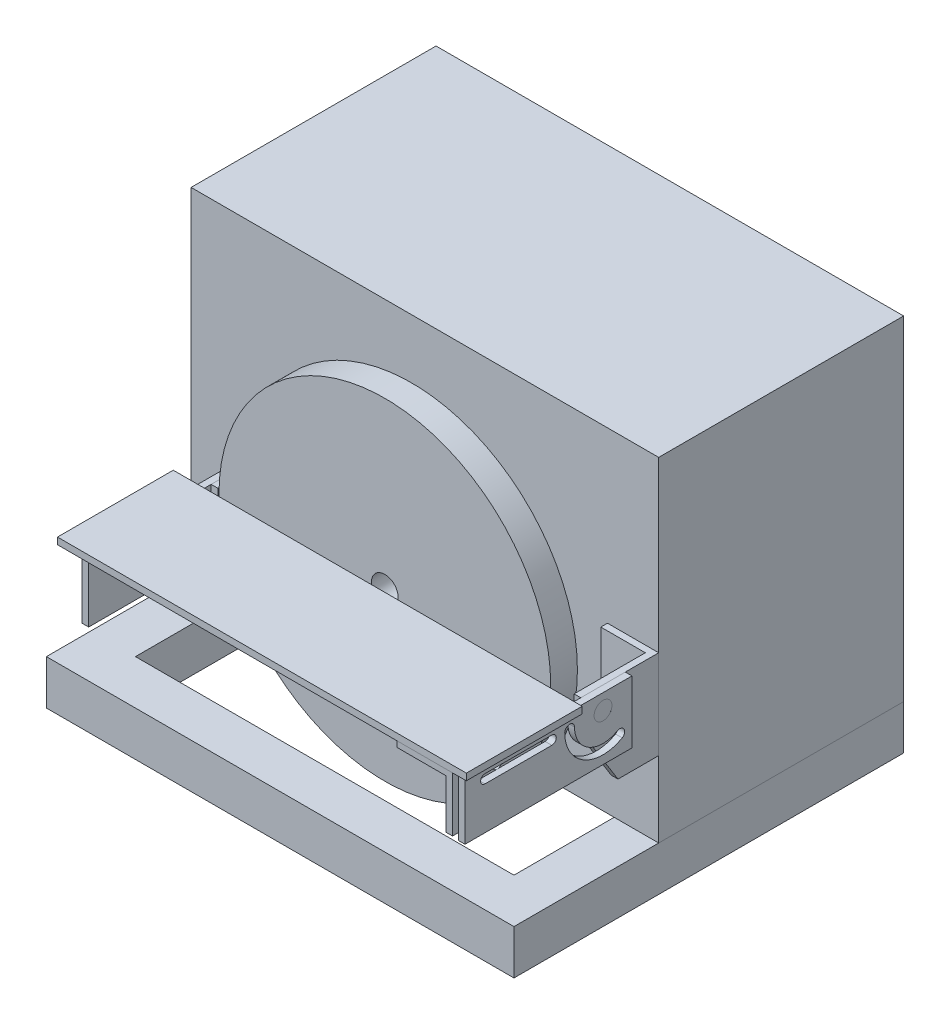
from build123d import *

# Parameters (mm, degrees)
BOSS_EXTRUDE1_DEPTH    = 20
SKETCH2_W              = 210
SKETCH2_H              = 110
BOSS_EXTRUDE2_DEPTH    = 150
SKETCH3_R              = 4
BOSS_EXTRUDE3_DEPTH    = 28
SKETCH4_R              = 18.5
BOSS_EXTRUDE4_DEPTH    = 5
SKETCH5_R              = 6
BOSS_EXTRUDE5_DEPTH    = 2
SKETCH6_R              = 74.5
SKETCH6_R_2            = 6
BOSS_EXTRUDE6_DEPTH    = 12
BOSS_EXTRUDE7_DEPTH    = 3
SKETCH13_R             = 4
BOSS_EXTRUDE12_DEPTH   = 3
SKETCH13_W             = 23
SKETCH13_H             = 40
BOSS_EXTRUDE12_2_DEPTH = 3
SKETCH14_W             = 3
SKETCH14_H             = 40
BOSS_EXTRUDE13_DEPTH   = 32
SKETCH15_R             = 4
BOSS_EXTRUDE14_DEPTH   = 3
SKETCH16_W             = 75
SKETCH16_H             = 28
SKETCH16_R             = 4
BOSS_EXTRUDE15_DEPTH   = 3
BOSS_EXTRUDE16_DEPTH   = 3
SKETCH18_W             = 3
SKETCH18_H             = 40
BOSS_EXTRUDE17_DEPTH   = 22
SKETCH19_R             = 2
CUT_EXTRUDE1_DEPTH     = 3
SKETCH21_W             = 23
SKETCH21_H             = 40
BOSS_EXTRUDE18_DEPTH   = 3
SKETCH23_W             = 3
SKETCH23_H             = 40
BOSS_EXTRUDE20_DEPTH   = 32
SKETCH25_R             = 4
BOSS_EXTRUDE21_DEPTH   = 3
SKETCH26_W             = 75
SKETCH26_H             = 28
SKETCH26_R             = 4
BOSS_EXTRUDE22_DEPTH   = 3
CUT_EXTRUDE3_DEPTH     = 3
SKETCH28_R             = 4
BOSS_EXTRUDE23_DEPTH   = 3
SKETCH29_R             = 4
BOSS_EXTRUDE24_DEPTH   = 3


with BuildPart() as part:
    # Sketch1 → Boss-Extrude1 (new body)
    with BuildSketch(Plane(origin=(0, 0, 0), x_dir=(1, 0, 0), z_dir=(0, 1, 0))):
        Polygon((-85, 87.5), (-105, 87.5), (-105, -87.5), (105, -87.5), (105, 87.5), (85, 87.5), (85, 67.5), (85, -67.5), (-85, -67.5), (-85, 67.5), align=None)
    extrude(amount=BOSS_EXTRUDE1_DEPTH)


with BuildPart() as body_2:
    # Sketch2 → Boss-Extrude2 (new body)
    with BuildSketch(Plane(origin=(0, 20, 0), x_dir=(1, 0, 0), z_dir=(0, 1, 0))):
        with Locations((0, 32.5)):
            Rectangle(SKETCH2_W, SKETCH2_H)
    extrude(amount=BOSS_EXTRUDE2_DEPTH)

    # Sketch3 → Boss-Extrude3 (add)
    with BuildSketch(Plane.XY.offset(22.5)):
        with Locations(Location((22, 97, 0), (0, 0, 180))):
            Circle(SKETCH3_R)
    extrude(amount=BOSS_EXTRUDE3_DEPTH)

    # Sketch4 → Boss-Extrude4 (add)
    with BuildSketch(Plane.XY.offset(50.5)):
        with Locations((22, 97)):
            Circle(SKETCH4_R)
    extrude(amount=-BOSS_EXTRUDE4_DEPTH)

    # Sketch5 → Boss-Extrude5 (add)
    with BuildSketch(Plane.XY.offset(50.5)):
        with Locations((22, 97)):
            Circle(SKETCH5_R)
    extrude(amount=BOSS_EXTRUDE5_DEPTH)


with BuildPart() as body_3:
    # Sketch6 → Boss-Extrude6 (new body)
    with BuildSketch(Plane.XY.offset(50.5)):
        with Locations((22, 97)):
            Circle(SKETCH6_R)
        with Locations((22, 97)):
            Circle(SKETCH6_R_2, mode=Mode.SUBTRACT)
    extrude(amount=BOSS_EXTRUDE6_DEPTH)


with BuildPart() as body_4:
    # Sketch7 → Boss-Extrude7 (new body)
    with BuildSketch(Plane(origin=(0, 97, 0), x_dir=(-1, 0, 0), z_dir=(0, -1, 0))):
        Polygon((-97.5, -63.5), (53.5, -63.5), (72.015628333, -63.5), (72.015628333, -115.5), (-111.610966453, -115.5), (-111.610966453, -63.5), align=None)
    extrude(amount=BOSS_EXTRUDE7_DEPTH)


with BuildPart() as body_5:
    # Sketch13 → Boss-Extrude12 (new body)
    with BuildSketch(Plane.XY.offset(22.5)):
        with Locations((22, 97)):
            Circle(SKETCH13_R)
    extrude(amount=BOSS_EXTRUDE12_DEPTH)


with BuildPart() as body_6:
    # Sketch13 → Boss-Extrude12 2 (new body)
    with BuildSketch(Plane.XY.offset(22.5)):
        with Locations((93.5, 74)):
            Rectangle(SKETCH13_W, SKETCH13_H)
    extrude(amount=BOSS_EXTRUDE12_2_DEPTH)

    # Sketch14 → Boss-Extrude13 (add)
    with BuildSketch(Plane.XY.offset(25.5)):
        with Locations((103.5, 74)):
            Rectangle(SKETCH14_W, SKETCH14_H)
    extrude(amount=BOSS_EXTRUDE13_DEPTH)

    # Sketch15 → Boss-Extrude14 (add)
    with BuildSketch(Plane(origin=(105, 0, 0), x_dir=(0, 0, -1), z_dir=(1, 0, 0))):
        with Locations(Location((-50.5, 87, 0), (0, 0, 180))):
            Circle(SKETCH15_R)
    extrude(amount=BOSS_EXTRUDE14_DEPTH)

    # Sketch27 → Cut-Extrude3 (cut)
    with BuildSketch(Plane(origin=(105, 0, 0), x_dir=(0, 0, -1), z_dir=(1, 0, 0))):
        Polygon((-40.781047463, 54), (-57.5, 80.800602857), (-57.5, 54), align=None)
    extrude(amount=-CUT_EXTRUDE3_DEPTH, mode=Mode.SUBTRACT)

    # Sketch29 → Boss-Extrude24 (add)
    with BuildSketch(Plane.ZY.offset(-102)):
        with Locations((50.5, 87)):
            Circle(SKETCH29_R)
    extrude(amount=BOSS_EXTRUDE24_DEPTH)


with BuildPart() as body_7:
    # Sketch16 → Boss-Extrude15 (new body)
    with BuildSketch(Plane(origin=(105, 0, 0), x_dir=(0, 0, -1), z_dir=(1, 0, 0))):
        with Locations((-75, 80)):
            Rectangle(SKETCH16_W, SKETCH16_H)
        with Locations(Location((-50.5, 87, 0), (0, 0, 180))):
            Circle(SKETCH16_R, mode=Mode.SUBTRACT)
        with BuildLine():
            Line((-103.5, 88.995987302), (-73.5, 88.995987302))
            ThreePointArc((-73.5, 88.995987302), (-71.504012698, 87), (-73.5, 85.004012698))
            Line((-73.5, 85.004012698), (-103.5, 85.004012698))
            ThreePointArc((-103.5, 85.004012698), (-105.495987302, 87), (-103.5, 88.995987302))
        make_face(mode=Mode.SUBTRACT)
        with BuildLine():
            ThreePointArc((-44.1, 75.914874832), (-56.9, 75.914874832), (-63.3, 87))
            ThreePointArc((-63.3, 87), (-65.5, 89.2), (-67.7, 87))
            ThreePointArc((-67.7, 87), (-59.1, 72.104363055), (-41.9, 72.104363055))
            ThreePointArc((-41.9, 72.104363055), (-41.094744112, 75.109618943), (-44.1, 75.914874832))
        make_face(mode=Mode.SUBTRACT)
    extrude(amount=BOSS_EXTRUDE15_DEPTH)


with BuildPart() as body_8:
    # Sketch17 → Boss-Extrude16 (new body)
    with BuildSketch(Plane.XZ.offset(-94)):
        Polygon((80, 75.084724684), (105, 75.084724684), (105, 112.5), (105, 115.084724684), (80, 115.084724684), align=None)
    extrude(amount=BOSS_EXTRUDE16_DEPTH)

    # Sketch18 → Boss-Extrude17 (add)
    with BuildSketch(Plane.XZ.offset(-91)):
        with Locations((103.5, 95.084724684)):
            Rectangle(SKETCH18_W, SKETCH18_H)
    extrude(amount=BOSS_EXTRUDE17_DEPTH)

    # Sketch19 → Cut-Extrude1 (cut)
    with BuildSketch(Plane.ZY.offset(-102)):
        with Locations((95.084724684, 87)):
            Circle(SKETCH19_R)
    extrude(amount=-CUT_EXTRUDE1_DEPTH, mode=Mode.SUBTRACT)


with BuildPart() as body_9:
    # Sketch21 → Boss-Extrude18 (new body)
    with BuildSketch(Plane.XY.offset(22.5)):
        with Locations((-49.5, 74)):
            Rectangle(SKETCH21_W, SKETCH21_H)
    extrude(amount=BOSS_EXTRUDE18_DEPTH)

    # Sketch23 → Boss-Extrude20 (add)
    with BuildSketch(Plane.XY.offset(25.5)):
        with Locations((-59.5, 74)):
            Rectangle(SKETCH23_W, SKETCH23_H)
    extrude(amount=BOSS_EXTRUDE20_DEPTH)

    # Sketch25 → Boss-Extrude21 (add)
    with BuildSketch(Plane.ZY.offset(61)):
        with Locations((50.5, 87)):
            Circle(SKETCH25_R)
    extrude(amount=BOSS_EXTRUDE21_DEPTH)

    # Sketch28 → Boss-Extrude23 (add)
    with BuildSketch(Plane(origin=(-58, 0, 0), x_dir=(0, 0, -1), z_dir=(1, 0, 0))):
        with Locations(Location((-50.5, 87, 0), (0, 0, 180))):
            Circle(SKETCH28_R)
    extrude(amount=BOSS_EXTRUDE23_DEPTH)


with BuildPart() as body_10:
    # Sketch26 → Boss-Extrude22 (new body)
    with BuildSketch(Plane.ZY.offset(61)):
        with Locations((75, 80)):
            Rectangle(SKETCH26_W, SKETCH26_H)
        with Locations((50.5, 87)):
            Circle(SKETCH26_R, mode=Mode.SUBTRACT)
        with BuildLine():
            ThreePointArc((41.9, 72.104363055), (59.1, 72.104363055), (67.7, 87))
            ThreePointArc((67.7, 87), (65.5, 89.2), (63.3, 87))
            ThreePointArc((63.3, 87), (56.9, 75.914874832), (44.1, 75.914874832))
            ThreePointArc((44.1, 75.914874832), (41.094744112, 75.109618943), (41.9, 72.104363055))
        make_face(mode=Mode.SUBTRACT)
    extrude(amount=BOSS_EXTRUDE22_DEPTH)


solid = Compound([part.part, body_2.part, body_3.part, body_4.part, body_5.part, body_6.part, body_7.part, body_8.part, body_9.part, body_10.part])
